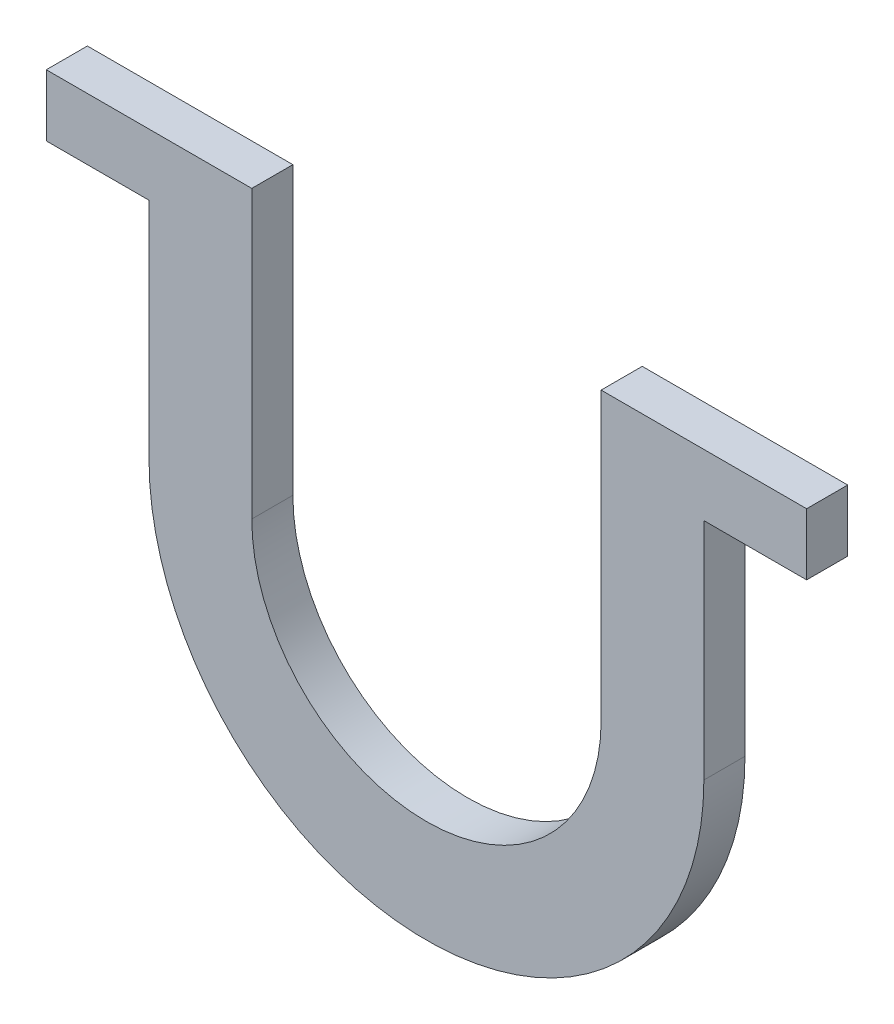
ISO-10303-21;
HEADER;
FILE_DESCRIPTION(('STEP AP214'),'2;1');
FILE_NAME('part.step','',(''),(''),'','','');
FILE_SCHEMA(('AUTOMOTIVE_DESIGN { 1 0 10303 214 1 1 1 1 }'));
ENDSEC;
DATA;
#1=APPLICATION_CONTEXT('core data for automotive mechanical design processes');
#2=APPLICATION_PROTOCOL_DEFINITION('international standard','automotive_design',2000,#1);
#3=PRODUCT_CONTEXT('',#1,'mechanical');
#4=PRODUCT('Part','Part','',(#3));
#5=PRODUCT_RELATED_PRODUCT_CATEGORY('part','',(#4));
#6=PRODUCT_DEFINITION_FORMATION('','',#4);
#7=PRODUCT_DEFINITION_CONTEXT('part definition',#1,'design');
#8=PRODUCT_DEFINITION('design','',#6,#7);
#9=PRODUCT_DEFINITION_SHAPE('','',#8);
#10=(LENGTH_UNIT() NAMED_UNIT(*) SI_UNIT(.MILLI.,.METRE.));
#11=(NAMED_UNIT(*) PLANE_ANGLE_UNIT() SI_UNIT($,.RADIAN.));
#12=(NAMED_UNIT(*) SI_UNIT($,.STERADIAN.) SOLID_ANGLE_UNIT());
#13=UNCERTAINTY_MEASURE_WITH_UNIT(LENGTH_MEASURE(1.E-05),#10,'distance_accuracy_value','');
#14=(GEOMETRIC_REPRESENTATION_CONTEXT(3) GLOBAL_UNCERTAINTY_ASSIGNED_CONTEXT((#13)) GLOBAL_UNIT_ASSIGNED_CONTEXT((#10,
#11,#12)) REPRESENTATION_CONTEXT('',''));
#15=CARTESIAN_POINT('',(0.,0.,0.));
#16=DIRECTION('',(0.,0.,1.));
#17=DIRECTION('',(1.,0.,0.));
#18=AXIS2_PLACEMENT_3D('',#15,#16,#17);
#19=CARTESIAN_POINT('',(-41.9892681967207,29.4608194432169,4.));
#20=DIRECTION('',(1.,0.,0.));
#21=DIRECTION('',(0.,0.,-1.));
#22=AXIS2_PLACEMENT_3D('',#19,#20,#21);
#23=PLANE('',#22);
#24=DIRECTION('',(0.,0.,1.));
#25=VECTOR('',#24,1.);
#26=CARTESIAN_POINT('',(-41.9892681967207,23.4608194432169,0.));
#27=LINE('',#26,#25);
#28=CARTESIAN_POINT('',(-41.9892681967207,23.4608194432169,0.));
#29=VERTEX_POINT('',#28);
#30=CARTESIAN_POINT('',(-41.9892681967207,23.4608194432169,4.));
#31=VERTEX_POINT('',#30);
#32=EDGE_CURVE('E145',#29,#31,#27,.T.);
#33=ORIENTED_EDGE('',*,*,#32,.F.);
#34=DIRECTION('',(0.,-1.,0.));
#35=VECTOR('',#34,1.);
#36=CARTESIAN_POINT('',(-41.9892681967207,29.4608194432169,0.));
#37=LINE('',#36,#35);
#38=CARTESIAN_POINT('',(-41.9892681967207,1.59334812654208,0.));
#39=VERTEX_POINT('',#38);
#40=EDGE_CURVE('E149',#29,#39,#37,.T.);
#41=ORIENTED_EDGE('',*,*,#40,.T.);
#42=DIRECTION('',(0.,0.,-1.));
#43=VECTOR('',#42,1.);
#44=CARTESIAN_POINT('',(-41.9892681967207,1.59334812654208,4.));
#45=LINE('',#44,#43);
#46=CARTESIAN_POINT('',(-41.9892681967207,1.59334812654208,4.));
#47=VERTEX_POINT('',#46);
#48=EDGE_CURVE('E189',#47,#39,#45,.T.);
#49=ORIENTED_EDGE('',*,*,#48,.F.);
#50=DIRECTION('',(0.,-1.,0.));
#51=VECTOR('',#50,1.);
#52=CARTESIAN_POINT('',(-41.9892681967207,29.4608194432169,4.));
#53=LINE('',#52,#51);
#54=EDGE_CURVE('E50',#31,#47,#53,.T.);
#55=ORIENTED_EDGE('',*,*,#54,.F.);
#56=EDGE_LOOP('',(#33,#41,#49,#55));
#57=FACE_BOUND('',#56,.T.);
#58=ADVANCED_FACE('F35',(#57),#23,.F.);
#59=CARTESIAN_POINT('',(12.0107318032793,29.4608194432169,4.));
#60=DIRECTION('',(-1.,0.,0.));
#61=DIRECTION('',(0.,-1.,0.));
#62=AXIS2_PLACEMENT_3D('',#59,#60,#61);
#63=PLANE('',#62);
#64=DIRECTION('',(0.,0.,-1.));
#65=VECTOR('',#64,1.);
#66=CARTESIAN_POINT('',(12.0107318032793,23.4608194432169,4.));
#67=LINE('',#66,#65);
#68=CARTESIAN_POINT('',(12.0107318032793,23.4608194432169,4.));
#69=VERTEX_POINT('',#68);
#70=CARTESIAN_POINT('',(12.0107318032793,23.4608194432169,0.));
#71=VERTEX_POINT('',#70);
#72=EDGE_CURVE('E58',#69,#71,#67,.T.);
#73=ORIENTED_EDGE('',*,*,#72,.F.);
#74=DIRECTION('',(0.,1.,0.));
#75=VECTOR('',#74,1.);
#76=CARTESIAN_POINT('',(12.0107318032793,29.4608194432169,4.));
#77=LINE('',#76,#75);
#78=CARTESIAN_POINT('',(12.0107318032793,1.59334812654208,4.));
#79=VERTEX_POINT('',#78);
#80=EDGE_CURVE('E176',#79,#69,#77,.T.);
#81=ORIENTED_EDGE('',*,*,#80,.F.);
#82=DIRECTION('',(0.,0.,-1.));
#83=VECTOR('',#82,1.);
#84=CARTESIAN_POINT('',(12.0107318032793,1.59334812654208,4.));
#85=LINE('',#84,#83);
#86=CARTESIAN_POINT('',(12.0107318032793,1.59334812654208,0.));
#87=VERTEX_POINT('',#86);
#88=EDGE_CURVE('E11',#79,#87,#85,.T.);
#89=ORIENTED_EDGE('',*,*,#88,.T.);
#90=DIRECTION('',(0.,1.,0.));
#91=VECTOR('',#90,1.);
#92=CARTESIAN_POINT('',(12.0107318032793,29.4608194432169,0.));
#93=LINE('',#92,#91);
#94=EDGE_CURVE('E192',#87,#71,#93,.T.);
#95=ORIENTED_EDGE('',*,*,#94,.T.);
#96=EDGE_LOOP('',(#73,#81,#89,#95));
#97=FACE_BOUND('',#96,.T.);
#98=ADVANCED_FACE('F248',(#97),#63,.F.);
#99=CARTESIAN_POINT('',(-14.9892681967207,1.59334812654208,4.));
#100=DIRECTION('',(0.,0.,-1.));
#101=DIRECTION('',(-1.,0.,0.));
#102=AXIS2_PLACEMENT_3D('',#99,#100,#101);
#103=CYLINDRICAL_SURFACE('',#102,27.);
#104=CARTESIAN_POINT('',(-14.9892681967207,1.59334812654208,0.));
#105=DIRECTION('',(0.,0.,1.));
#106=DIRECTION('',(1.,0.,0.));
#107=AXIS2_PLACEMENT_3D('',#104,#105,#106);
#108=CIRCLE('',#107,27.);
#109=EDGE_CURVE('E172',#39,#87,#108,.T.);
#110=ORIENTED_EDGE('',*,*,#109,.T.);
#111=ORIENTED_EDGE('',*,*,#88,.F.);
#112=CARTESIAN_POINT('',(-14.9892681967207,1.59334812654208,4.));
#113=DIRECTION('',(0.,0.,1.));
#114=DIRECTION('',(1.,0.,0.));
#115=AXIS2_PLACEMENT_3D('',#112,#113,#114);
#116=CIRCLE('',#115,27.);
#117=EDGE_CURVE('E173',#47,#79,#116,.T.);
#118=ORIENTED_EDGE('',*,*,#117,.F.);
#119=ORIENTED_EDGE('',*,*,#48,.T.);
#120=EDGE_LOOP('',(#110,#111,#118,#119));
#121=FACE_BOUND('',#120,.T.);
#122=ADVANCED_FACE('F37',(#121),#103,.T.);
#123=CARTESIAN_POINT('',(2.01073180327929,29.4608194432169,4.));
#124=DIRECTION('',(0.,-1.,0.));
#125=DIRECTION('',(0.,0.,-1.));
#126=AXIS2_PLACEMENT_3D('',#123,#124,#125);
#127=PLANE('',#126);
#128=DIRECTION('',(-1.,0.,0.));
#129=VECTOR('',#128,1.);
#130=CARTESIAN_POINT('',(2.01073180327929,29.4608194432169,0.));
#131=LINE('',#130,#129);
#132=CARTESIAN_POINT('',(22.0107318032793,29.4608194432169,0.));
#133=VERTEX_POINT('',#132);
#134=CARTESIAN_POINT('',(2.01073180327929,29.4608194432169,0.));
#135=VERTEX_POINT('',#134);
#136=EDGE_CURVE('E194',#133,#135,#131,.T.);
#137=ORIENTED_EDGE('',*,*,#136,.T.);
#138=DIRECTION('',(0.,0.,-1.));
#139=VECTOR('',#138,1.);
#140=CARTESIAN_POINT('',(2.01073180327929,29.4608194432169,4.));
#141=LINE('',#140,#139);
#142=CARTESIAN_POINT('',(2.01073180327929,29.4608194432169,4.));
#143=VERTEX_POINT('',#142);
#144=EDGE_CURVE('E43',#143,#135,#141,.T.);
#145=ORIENTED_EDGE('',*,*,#144,.F.);
#146=DIRECTION('',(-1.,0.,0.));
#147=VECTOR('',#146,1.);
#148=CARTESIAN_POINT('',(2.01073180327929,29.4608194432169,4.));
#149=LINE('',#148,#147);
#150=CARTESIAN_POINT('',(22.0107318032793,29.4608194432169,4.));
#151=VERTEX_POINT('',#150);
#152=EDGE_CURVE('E178',#151,#143,#149,.T.);
#153=ORIENTED_EDGE('',*,*,#152,.F.);
#154=DIRECTION('',(0.,0.,1.));
#155=VECTOR('',#154,1.);
#156=CARTESIAN_POINT('',(22.0107318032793,29.4608194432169,4.));
#157=LINE('',#156,#155);
#158=EDGE_CURVE('E163',#133,#151,#157,.T.);
#159=ORIENTED_EDGE('',*,*,#158,.F.);
#160=EDGE_LOOP('',(#137,#145,#153,#159));
#161=FACE_BOUND('',#160,.T.);
#162=ADVANCED_FACE('F240',(#161),#127,.F.);
#163=CARTESIAN_POINT('',(2.01073180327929,29.4608194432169,4.));
#164=DIRECTION('',(1.,0.,0.));
#165=DIRECTION('',(0.,0.,-1.));
#166=AXIS2_PLACEMENT_3D('',#163,#164,#165);
#167=PLANE('',#166);
#168=DIRECTION('',(0.,-1.,0.));
#169=VECTOR('',#168,1.);
#170=CARTESIAN_POINT('',(2.01073180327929,29.4608194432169,0.));
#171=LINE('',#170,#169);
#172=CARTESIAN_POINT('',(2.01073180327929,1.59334812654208,0.));
#173=VERTEX_POINT('',#172);
#174=EDGE_CURVE('E196',#135,#173,#171,.T.);
#175=ORIENTED_EDGE('',*,*,#174,.T.);
#176=DIRECTION('',(0.,0.,-1.));
#177=VECTOR('',#176,1.);
#178=CARTESIAN_POINT('',(2.01073180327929,1.59334812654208,4.));
#179=LINE('',#178,#177);
#180=CARTESIAN_POINT('',(2.01073180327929,1.59334812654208,4.));
#181=VERTEX_POINT('',#180);
#182=EDGE_CURVE('E213',#181,#173,#179,.T.);
#183=ORIENTED_EDGE('',*,*,#182,.F.);
#184=DIRECTION('',(0.,-1.,0.));
#185=VECTOR('',#184,1.);
#186=CARTESIAN_POINT('',(2.01073180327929,29.4608194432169,4.));
#187=LINE('',#186,#185);
#188=EDGE_CURVE('E180',#143,#181,#187,.T.);
#189=ORIENTED_EDGE('',*,*,#188,.F.);
#190=ORIENTED_EDGE('',*,*,#144,.T.);
#191=EDGE_LOOP('',(#175,#183,#189,#190));
#192=FACE_BOUND('',#191,.T.);
#193=ADVANCED_FACE('F220',(#192),#167,.F.);
#194=CARTESIAN_POINT('',(-14.9892681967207,1.59334812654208,4.));
#195=DIRECTION('',(0.,0.,-1.));
#196=DIRECTION('',(-1.,0.,0.));
#197=AXIS2_PLACEMENT_3D('',#194,#195,#196);
#198=CYLINDRICAL_SURFACE('',#197,17.);
#199=CARTESIAN_POINT('',(-14.9892681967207,1.59334812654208,0.));
#200=DIRECTION('',(0.,0.,-1.));
#201=DIRECTION('',(1.,0.,0.));
#202=AXIS2_PLACEMENT_3D('',#199,#200,#201);
#203=CIRCLE('',#202,17.);
#204=CARTESIAN_POINT('',(-31.9892681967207,1.59334812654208,0.));
#205=VERTEX_POINT('',#204);
#206=EDGE_CURVE('E198',#173,#205,#203,.T.);
#207=ORIENTED_EDGE('',*,*,#206,.T.);
#208=DIRECTION('',(0.,0.,-1.));
#209=VECTOR('',#208,1.);
#210=CARTESIAN_POINT('',(-31.9892681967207,1.59334812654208,4.));
#211=LINE('',#210,#209);
#212=CARTESIAN_POINT('',(-31.9892681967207,1.59334812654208,4.));
#213=VERTEX_POINT('',#212);
#214=EDGE_CURVE('E210',#213,#205,#211,.T.);
#215=ORIENTED_EDGE('',*,*,#214,.F.);
#216=CARTESIAN_POINT('',(-14.9892681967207,1.59334812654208,4.));
#217=DIRECTION('',(0.,0.,-1.));
#218=DIRECTION('',(1.,0.,0.));
#219=AXIS2_PLACEMENT_3D('',#216,#217,#218);
#220=CIRCLE('',#219,17.);
#221=EDGE_CURVE('E182',#181,#213,#220,.T.);
#222=ORIENTED_EDGE('',*,*,#221,.F.);
#223=ORIENTED_EDGE('',*,*,#182,.T.);
#224=EDGE_LOOP('',(#207,#215,#222,#223));
#225=FACE_BOUND('',#224,.T.);
#226=ADVANCED_FACE('F228',(#225),#198,.F.);
#227=CARTESIAN_POINT('',(-31.9892681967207,29.4608194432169,4.));
#228=DIRECTION('',(-1.,0.,0.));
#229=DIRECTION('',(0.,0.,1.));
#230=AXIS2_PLACEMENT_3D('',#227,#228,#229);
#231=PLANE('',#230);
#232=DIRECTION('',(0.,1.,0.));
#233=VECTOR('',#232,1.);
#234=CARTESIAN_POINT('',(-31.9892681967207,29.4608194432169,0.));
#235=LINE('',#234,#233);
#236=CARTESIAN_POINT('',(-31.9892681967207,29.4608194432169,0.));
#237=VERTEX_POINT('',#236);
#238=EDGE_CURVE('E200',#205,#237,#235,.T.);
#239=ORIENTED_EDGE('',*,*,#238,.T.);
#240=DIRECTION('',(0.,0.,-1.));
#241=VECTOR('',#240,1.);
#242=CARTESIAN_POINT('',(-31.9892681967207,29.4608194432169,4.));
#243=LINE('',#242,#241);
#244=CARTESIAN_POINT('',(-31.9892681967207,29.4608194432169,4.));
#245=VERTEX_POINT('',#244);
#246=EDGE_CURVE('E207',#245,#237,#243,.T.);
#247=ORIENTED_EDGE('',*,*,#246,.F.);
#248=DIRECTION('',(0.,1.,0.));
#249=VECTOR('',#248,1.);
#250=CARTESIAN_POINT('',(-31.9892681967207,29.4608194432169,4.));
#251=LINE('',#250,#249);
#252=EDGE_CURVE('E184',#213,#245,#251,.T.);
#253=ORIENTED_EDGE('',*,*,#252,.F.);
#254=ORIENTED_EDGE('',*,*,#214,.T.);
#255=EDGE_LOOP('',(#239,#247,#253,#254));
#256=FACE_BOUND('',#255,.T.);
#257=ADVANCED_FACE('F232',(#256),#231,.F.);
#258=CARTESIAN_POINT('',(-31.9892681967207,29.4608194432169,4.));
#259=DIRECTION('',(0.,-1.,0.));
#260=DIRECTION('',(0.,0.,-1.));
#261=AXIS2_PLACEMENT_3D('',#258,#259,#260);
#262=PLANE('',#261);
#263=DIRECTION('',(-1.,0.,0.));
#264=VECTOR('',#263,1.);
#265=CARTESIAN_POINT('',(-31.9892681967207,29.4608194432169,0.));
#266=LINE('',#265,#264);
#267=CARTESIAN_POINT('',(-51.9892681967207,29.4608194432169,0.));
#268=VERTEX_POINT('',#267);
#269=EDGE_CURVE('E202',#237,#268,#266,.T.);
#270=ORIENTED_EDGE('',*,*,#269,.T.);
#271=DIRECTION('',(0.,0.,-1.));
#272=VECTOR('',#271,1.);
#273=CARTESIAN_POINT('',(-51.9892681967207,29.4608194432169,0.));
#274=LINE('',#273,#272);
#275=CARTESIAN_POINT('',(-51.9892681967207,29.4608194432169,4.));
#276=VERTEX_POINT('',#275);
#277=EDGE_CURVE('E142',#276,#268,#274,.T.);
#278=ORIENTED_EDGE('',*,*,#277,.F.);
#279=DIRECTION('',(-1.,0.,0.));
#280=VECTOR('',#279,1.);
#281=CARTESIAN_POINT('',(-31.9892681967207,29.4608194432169,4.));
#282=LINE('',#281,#280);
#283=EDGE_CURVE('E186',#245,#276,#282,.T.);
#284=ORIENTED_EDGE('',*,*,#283,.F.);
#285=ORIENTED_EDGE('',*,*,#246,.T.);
#286=EDGE_LOOP('',(#270,#278,#284,#285));
#287=FACE_BOUND('',#286,.T.);
#288=ADVANCED_FACE('F253',(#287),#262,.F.);
#289=CARTESIAN_POINT('',(-14.9892681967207,1.59334812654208,4.));
#290=DIRECTION('',(0.,0.,1.));
#291=DIRECTION('',(1.,0.,0.));
#292=AXIS2_PLACEMENT_3D('',#289,#290,#291);
#293=PLANE('',#292);
#294=ORIENTED_EDGE('',*,*,#117,.T.);
#295=ORIENTED_EDGE('',*,*,#80,.T.);
#296=DIRECTION('',(-1.,0.,0.));
#297=VECTOR('',#296,1.);
#298=CARTESIAN_POINT('',(22.0107318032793,23.4608194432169,4.));
#299=LINE('',#298,#297);
#300=CARTESIAN_POINT('',(22.0107318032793,23.4608194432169,4.));
#301=VERTEX_POINT('',#300);
#302=EDGE_CURVE('E169',#301,#69,#299,.T.);
#303=ORIENTED_EDGE('',*,*,#302,.F.);
#304=DIRECTION('',(0.,-1.,0.));
#305=VECTOR('',#304,1.);
#306=CARTESIAN_POINT('',(22.0107318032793,29.4608194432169,4.));
#307=LINE('',#306,#305);
#308=EDGE_CURVE('E151',#151,#301,#307,.T.);
#309=ORIENTED_EDGE('',*,*,#308,.F.);
#310=ORIENTED_EDGE('',*,*,#152,.T.);
#311=ORIENTED_EDGE('',*,*,#188,.T.);
#312=ORIENTED_EDGE('',*,*,#221,.T.);
#313=ORIENTED_EDGE('',*,*,#252,.T.);
#314=ORIENTED_EDGE('',*,*,#283,.T.);
#315=DIRECTION('',(0.,1.,0.));
#316=VECTOR('',#315,1.);
#317=CARTESIAN_POINT('',(-51.9892681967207,29.4608194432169,4.));
#318=LINE('',#317,#316);
#319=CARTESIAN_POINT('',(-51.9892681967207,23.4608194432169,4.));
#320=VERTEX_POINT('',#319);
#321=EDGE_CURVE('E135',#320,#276,#318,.T.);
#322=ORIENTED_EDGE('',*,*,#321,.F.);
#323=DIRECTION('',(1.,0.,0.));
#324=VECTOR('',#323,1.);
#325=CARTESIAN_POINT('',(-51.9892681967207,23.4608194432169,4.));
#326=LINE('',#325,#324);
#327=EDGE_CURVE('E131',#320,#31,#326,.T.);
#328=ORIENTED_EDGE('',*,*,#327,.T.);
#329=ORIENTED_EDGE('',*,*,#54,.T.);
#330=EDGE_LOOP('',(#294,#295,#303,#309,#310,#311,#312,#313,#314,#322,#328,#329));
#331=FACE_BOUND('',#330,.T.);
#332=ADVANCED_FACE('F236',(#331),#293,.T.);
#333=CARTESIAN_POINT('',(-14.9892681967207,1.59334812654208,0.));
#334=DIRECTION('',(0.,0.,1.));
#335=DIRECTION('',(1.,0.,0.));
#336=AXIS2_PLACEMENT_3D('',#333,#334,#335);
#337=PLANE('',#336);
#338=ORIENTED_EDGE('',*,*,#109,.F.);
#339=ORIENTED_EDGE('',*,*,#40,.F.);
#340=DIRECTION('',(1.,0.,0.));
#341=VECTOR('',#340,1.);
#342=CARTESIAN_POINT('',(-51.9892681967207,23.4608194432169,0.));
#343=LINE('',#342,#341);
#344=CARTESIAN_POINT('',(-51.9892681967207,23.4608194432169,0.));
#345=VERTEX_POINT('',#344);
#346=EDGE_CURVE('E129',#345,#29,#343,.T.);
#347=ORIENTED_EDGE('',*,*,#346,.F.);
#348=DIRECTION('',(0.,-1.,0.));
#349=VECTOR('',#348,1.);
#350=CARTESIAN_POINT('',(-51.9892681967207,29.4608194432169,0.));
#351=LINE('',#350,#349);
#352=EDGE_CURVE('E136',#268,#345,#351,.T.);
#353=ORIENTED_EDGE('',*,*,#352,.F.);
#354=ORIENTED_EDGE('',*,*,#269,.F.);
#355=ORIENTED_EDGE('',*,*,#238,.F.);
#356=ORIENTED_EDGE('',*,*,#206,.F.);
#357=ORIENTED_EDGE('',*,*,#174,.F.);
#358=ORIENTED_EDGE('',*,*,#136,.F.);
#359=DIRECTION('',(0.,1.,0.));
#360=VECTOR('',#359,1.);
#361=CARTESIAN_POINT('',(22.0107318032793,29.4608194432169,0.));
#362=LINE('',#361,#360);
#363=CARTESIAN_POINT('',(22.0107318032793,23.4608194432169,0.));
#364=VERTEX_POINT('',#363);
#365=EDGE_CURVE('E160',#364,#133,#362,.T.);
#366=ORIENTED_EDGE('',*,*,#365,.F.);
#367=DIRECTION('',(-1.,0.,0.));
#368=VECTOR('',#367,1.);
#369=CARTESIAN_POINT('',(22.0107318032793,23.4608194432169,0.));
#370=LINE('',#369,#368);
#371=EDGE_CURVE('E165',#364,#71,#370,.T.);
#372=ORIENTED_EDGE('',*,*,#371,.T.);
#373=ORIENTED_EDGE('',*,*,#94,.F.);
#374=EDGE_LOOP('',(#338,#339,#347,#353,#354,#355,#356,#357,#358,#366,#372,#373));
#375=FACE_BOUND('',#374,.T.);
#376=ADVANCED_FACE('F148',(#375),#337,.F.);
#377=CARTESIAN_POINT('',(22.0107318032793,23.4608194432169,4.));
#378=DIRECTION('',(0.,1.,0.));
#379=DIRECTION('',(-1.,0.,0.));
#380=AXIS2_PLACEMENT_3D('',#377,#378,#379);
#381=PLANE('',#380);
#382=ORIENTED_EDGE('',*,*,#72,.T.);
#383=ORIENTED_EDGE('',*,*,#371,.F.);
#384=DIRECTION('',(0.,0.,-1.));
#385=VECTOR('',#384,1.);
#386=CARTESIAN_POINT('',(22.0107318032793,23.4608194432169,4.));
#387=LINE('',#386,#385);
#388=EDGE_CURVE('E158',#301,#364,#387,.T.);
#389=ORIENTED_EDGE('',*,*,#388,.F.);
#390=ORIENTED_EDGE('',*,*,#302,.T.);
#391=EDGE_LOOP('',(#382,#383,#389,#390));
#392=FACE_BOUND('',#391,.T.);
#393=ADVANCED_FACE('F245',(#392),#381,.F.);
#394=CARTESIAN_POINT('',(22.0107318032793,0.,0.));
#395=DIRECTION('',(1.,0.,0.));
#396=DIRECTION('',(0.,0.,-1.));
#397=AXIS2_PLACEMENT_3D('',#394,#395,#396);
#398=PLANE('',#397);
#399=ORIENTED_EDGE('',*,*,#308,.T.);
#400=ORIENTED_EDGE('',*,*,#388,.T.);
#401=ORIENTED_EDGE('',*,*,#365,.T.);
#402=ORIENTED_EDGE('',*,*,#158,.T.);
#403=EDGE_LOOP('',(#399,#400,#401,#402));
#404=FACE_BOUND('',#403,.T.);
#405=ADVANCED_FACE('F242',(#404),#398,.T.);
#406=CARTESIAN_POINT('',(-51.9892681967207,23.4608194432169,0.));
#407=DIRECTION('',(0.,1.,0.));
#408=DIRECTION('',(0.,0.,1.));
#409=AXIS2_PLACEMENT_3D('',#406,#407,#408);
#410=PLANE('',#409);
#411=ORIENTED_EDGE('',*,*,#32,.T.);
#412=ORIENTED_EDGE('',*,*,#327,.F.);
#413=DIRECTION('',(0.,0.,1.));
#414=VECTOR('',#413,1.);
#415=CARTESIAN_POINT('',(-51.9892681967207,23.4608194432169,0.));
#416=LINE('',#415,#414);
#417=EDGE_CURVE('E125',#345,#320,#416,.T.);
#418=ORIENTED_EDGE('',*,*,#417,.F.);
#419=ORIENTED_EDGE('',*,*,#346,.T.);
#420=EDGE_LOOP('',(#411,#412,#418,#419));
#421=FACE_BOUND('',#420,.T.);
#422=ADVANCED_FACE('F127',(#421),#410,.F.);
#423=CARTESIAN_POINT('',(-51.9892681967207,0.,0.));
#424=DIRECTION('',(-1.,0.,0.));
#425=DIRECTION('',(0.,0.,1.));
#426=AXIS2_PLACEMENT_3D('',#423,#424,#425);
#427=PLANE('',#426);
#428=ORIENTED_EDGE('',*,*,#352,.T.);
#429=ORIENTED_EDGE('',*,*,#417,.T.);
#430=ORIENTED_EDGE('',*,*,#321,.T.);
#431=ORIENTED_EDGE('',*,*,#277,.T.);
#432=EDGE_LOOP('',(#428,#429,#430,#431));
#433=FACE_BOUND('',#432,.T.);
#434=ADVANCED_FACE('F140',(#433),#427,.T.);
#435=CLOSED_SHELL('',(#58,#98,#122,#162,#193,#226,#257,#288,#332,#376,#393,#405,#422,#434));
#436=MANIFOLD_SOLID_BREP('B2',#435);
#437=ADVANCED_BREP_SHAPE_REPRESENTATION('',(#18,#436),#14);
#438=SHAPE_DEFINITION_REPRESENTATION(#9,#437);
ENDSEC;
END-ISO-10303-21;
